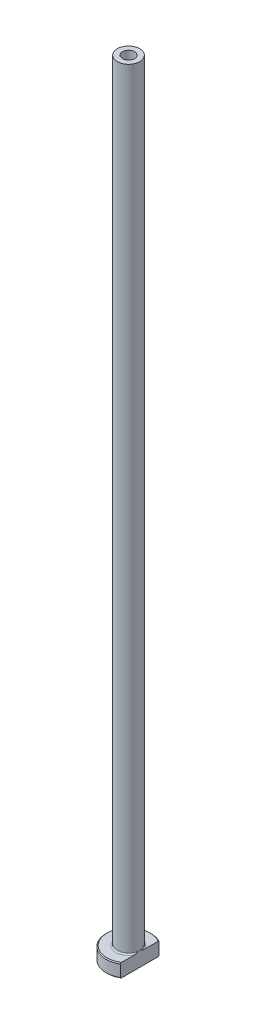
from build123d import *

# Parameters (mm, degrees)
FILLET1_R          = 0.3
CHAMFER1_SIZE      = 0.2
CUT_EXTRUDE1_DEPTH = 176.142798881
CHAMFER2_SIZE      = 0.5


with BuildPart() as part:
    # Sketch1 → Revolve1 (revolve)
    with BuildSketch(Plane.XY, mode=Mode.PRIVATE) as revolve1_sk:
        Polygon((-1.35, 175), (-2.5, 175), (-2.5, 3), (-5, 3), (-5, 0), (-1.6, 0), (-1.6, 118), (-1.35, 130), align=None)
    revolve(revolve1_sk.sketch.rotate(Axis((0, 92.187680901, 0), (0, -1, 0)), 270), axis=Axis((0, 92.187680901, 0), (0, -1, 0)))

    # Fillet1
    fillet1_edges = [part.edges().sort_by_distance(p)[0] for p in [
        (0, 3, -2.5),
    ]]
    fillet(fillet1_edges, radius=FILLET1_R)

    # Chamfer1
    chamfer1_edges = [part.edges().sort_by_distance(p)[0] for p in [
        (0, 0, -5),
        (0, 3, -5),
    ]]
    chamfer(chamfer1_edges, length=CHAMFER1_SIZE)

    # Sketch2 → Cut-Extrude1 (cut, through all)
    with BuildSketch(Plane.XZ):
        with BuildLine():
            Line((2.5, 4.330127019), (2.5, -4.330127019))
            ThreePointArc((2.5, -4.330127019), (5, 0), (2.5, 4.330127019))
        make_face()
    extrude(amount=-CUT_EXTRUDE1_DEPTH, mode=Mode.SUBTRACT)

    # Chamfer2
    chamfer2_edges = [part.edges().sort_by_distance(p)[0] for p in [
        (0, 0, -1.6),
    ]]
    chamfer(chamfer2_edges, length=CHAMFER2_SIZE)


solid = part.part
